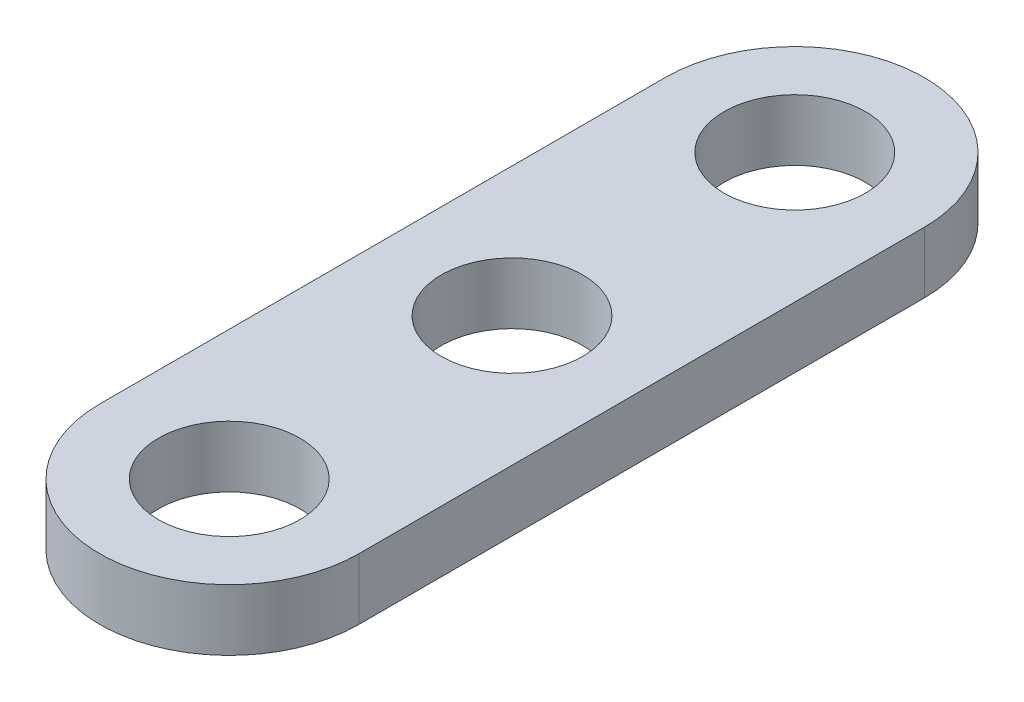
ISO-10303-21;
HEADER;
FILE_DESCRIPTION(('STEP AP214'),'2;1');
FILE_NAME('part.step','',(''),(''),'','','');
FILE_SCHEMA(('AUTOMOTIVE_DESIGN { 1 0 10303 214 1 1 1 1 }'));
ENDSEC;
DATA;
#1=APPLICATION_CONTEXT('core data for automotive mechanical design processes');
#2=APPLICATION_PROTOCOL_DEFINITION('international standard','automotive_design',2000,#1);
#3=PRODUCT_CONTEXT('',#1,'mechanical');
#4=PRODUCT('Part','Part','',(#3));
#5=PRODUCT_RELATED_PRODUCT_CATEGORY('part','',(#4));
#6=PRODUCT_DEFINITION_FORMATION('','',#4);
#7=PRODUCT_DEFINITION_CONTEXT('part definition',#1,'design');
#8=PRODUCT_DEFINITION('design','',#6,#7);
#9=PRODUCT_DEFINITION_SHAPE('','',#8);
#10=(LENGTH_UNIT() NAMED_UNIT(*) SI_UNIT(.MILLI.,.METRE.));
#11=(NAMED_UNIT(*) PLANE_ANGLE_UNIT() SI_UNIT($,.RADIAN.));
#12=(NAMED_UNIT(*) SI_UNIT($,.STERADIAN.) SOLID_ANGLE_UNIT());
#13=UNCERTAINTY_MEASURE_WITH_UNIT(LENGTH_MEASURE(1.E-05),#10,'distance_accuracy_value','');
#14=(GEOMETRIC_REPRESENTATION_CONTEXT(3) GLOBAL_UNCERTAINTY_ASSIGNED_CONTEXT((#13)) GLOBAL_UNIT_ASSIGNED_CONTEXT((#10,
#11,#12)) REPRESENTATION_CONTEXT('',''));
#15=CARTESIAN_POINT('',(0.,0.,0.));
#16=DIRECTION('',(0.,0.,1.));
#17=DIRECTION('',(1.,0.,0.));
#18=AXIS2_PLACEMENT_3D('',#15,#16,#17);
#19=CARTESIAN_POINT('',(0.,2.6,-12.));
#20=DIRECTION('',(0.,-1.,0.));
#21=DIRECTION('',(0.,0.,-1.));
#22=AXIS2_PLACEMENT_3D('',#19,#20,#21);
#23=PLANE('',#22);
#24=CARTESIAN_POINT('',(0.,2.6,-12.));
#25=DIRECTION('',(0.,1.,0.));
#26=DIRECTION('',(0.,0.,-1.));
#27=AXIS2_PLACEMENT_3D('',#24,#25,#26);
#28=CIRCLE('',#27,5.5);
#29=CARTESIAN_POINT('',(5.50000000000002,2.6,-12.));
#30=VERTEX_POINT('',#29);
#31=CARTESIAN_POINT('',(-5.49999999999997,2.6,-12.));
#32=VERTEX_POINT('',#31);
#33=EDGE_CURVE('E98',#30,#32,#28,.T.);
#34=ORIENTED_EDGE('',*,*,#33,.T.);
#35=DIRECTION('',(0.,0.,1.));
#36=VECTOR('',#35,1.);
#37=CARTESIAN_POINT('',(-5.49999999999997,2.6,12.));
#38=LINE('',#37,#36);
#39=CARTESIAN_POINT('',(-5.49999999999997,2.6,12.));
#40=VERTEX_POINT('',#39);
#41=EDGE_CURVE('E91',#32,#40,#38,.T.);
#42=ORIENTED_EDGE('',*,*,#41,.T.);
#43=CARTESIAN_POINT('',(0.,2.6,12.));
#44=DIRECTION('',(0.,1.,0.));
#45=DIRECTION('',(0.,0.,1.));
#46=AXIS2_PLACEMENT_3D('',#43,#44,#45);
#47=CIRCLE('',#46,5.5);
#48=CARTESIAN_POINT('',(5.50000000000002,2.6,12.));
#49=VERTEX_POINT('',#48);
#50=EDGE_CURVE('E96',#40,#49,#47,.T.);
#51=ORIENTED_EDGE('',*,*,#50,.T.);
#52=DIRECTION('',(0.,0.,-1.));
#53=VECTOR('',#52,1.);
#54=CARTESIAN_POINT('',(5.50000000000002,2.6,12.));
#55=LINE('',#54,#53);
#56=EDGE_CURVE('E62',#49,#30,#55,.T.);
#57=ORIENTED_EDGE('',*,*,#56,.T.);
#58=EDGE_LOOP('',(#34,#42,#51,#57));
#59=FACE_BOUND('',#58,.T.);
#60=CARTESIAN_POINT('',(0.,2.6,-12.));
#61=DIRECTION('',(0.,1.,0.));
#62=DIRECTION('',(0.,0.,1.));
#63=AXIS2_PLACEMENT_3D('',#60,#61,#62);
#64=CIRCLE('',#63,3.);
#65=CARTESIAN_POINT('',(0.,2.6,-9.));
#66=VERTEX_POINT('',#65);
#67=EDGE_CURVE('E117',#66,#66,#64,.T.);
#68=ORIENTED_EDGE('',*,*,#67,.F.);
#69=EDGE_LOOP('',(#68));
#70=FACE_BOUND('',#69,.T.);
#71=CARTESIAN_POINT('',(0.,2.6,0.));
#72=DIRECTION('',(0.,1.,0.));
#73=DIRECTION('',(0.,0.,1.));
#74=AXIS2_PLACEMENT_3D('',#71,#72,#73);
#75=CIRCLE('',#74,3.);
#76=CARTESIAN_POINT('',(0.,2.6,3.));
#77=VERTEX_POINT('',#76);
#78=EDGE_CURVE('E139',#77,#77,#75,.T.);
#79=ORIENTED_EDGE('',*,*,#78,.F.);
#80=EDGE_LOOP('',(#79));
#81=FACE_BOUND('',#80,.T.);
#82=CARTESIAN_POINT('',(0.,2.6,12.));
#83=DIRECTION('',(0.,1.,0.));
#84=DIRECTION('',(0.,0.,1.));
#85=AXIS2_PLACEMENT_3D('',#82,#83,#84);
#86=CIRCLE('',#85,3.);
#87=CARTESIAN_POINT('',(0.,2.6,15.));
#88=VERTEX_POINT('',#87);
#89=EDGE_CURVE('E146',#88,#88,#86,.T.);
#90=ORIENTED_EDGE('',*,*,#89,.F.);
#91=EDGE_LOOP('',(#90));
#92=FACE_BOUND('',#91,.T.);
#93=ADVANCED_FACE('F44',(#59,#70,#81,#92),#23,.F.);
#94=CARTESIAN_POINT('',(0.,0.,-12.));
#95=DIRECTION('',(0.,-1.,0.));
#96=DIRECTION('',(0.,0.,-1.));
#97=AXIS2_PLACEMENT_3D('',#94,#95,#96);
#98=PLANE('',#97);
#99=CARTESIAN_POINT('',(0.,0.,0.));
#100=DIRECTION('',(0.,1.,0.));
#101=DIRECTION('',(0.,0.,1.));
#102=AXIS2_PLACEMENT_3D('',#99,#100,#101);
#103=CIRCLE('',#102,3.);
#104=CARTESIAN_POINT('',(0.,0.,3.));
#105=VERTEX_POINT('',#104);
#106=EDGE_CURVE('E145',#105,#105,#103,.T.);
#107=ORIENTED_EDGE('',*,*,#106,.T.);
#108=EDGE_LOOP('',(#107));
#109=FACE_BOUND('',#108,.T.);
#110=CARTESIAN_POINT('',(0.,0.,-12.));
#111=DIRECTION('',(0.,1.,0.));
#112=DIRECTION('',(0.,0.,-1.));
#113=AXIS2_PLACEMENT_3D('',#110,#111,#112);
#114=CIRCLE('',#113,5.5);
#115=CARTESIAN_POINT('',(5.50000000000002,0.,-12.));
#116=VERTEX_POINT('',#115);
#117=CARTESIAN_POINT('',(-5.49999999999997,0.,-12.));
#118=VERTEX_POINT('',#117);
#119=EDGE_CURVE('E111',#116,#118,#114,.T.);
#120=ORIENTED_EDGE('',*,*,#119,.F.);
#121=DIRECTION('',(0.,0.,-1.));
#122=VECTOR('',#121,1.);
#123=CARTESIAN_POINT('',(5.50000000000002,0.,12.));
#124=LINE('',#123,#122);
#125=CARTESIAN_POINT('',(5.50000000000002,0.,12.));
#126=VERTEX_POINT('',#125);
#127=EDGE_CURVE('E88',#126,#116,#124,.T.);
#128=ORIENTED_EDGE('',*,*,#127,.F.);
#129=CARTESIAN_POINT('',(0.,0.,12.));
#130=DIRECTION('',(0.,1.,0.));
#131=DIRECTION('',(0.,0.,1.));
#132=AXIS2_PLACEMENT_3D('',#129,#130,#131);
#133=CIRCLE('',#132,5.5);
#134=CARTESIAN_POINT('',(-5.49999999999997,0.,12.));
#135=VERTEX_POINT('',#134);
#136=EDGE_CURVE('E79',#135,#126,#133,.T.);
#137=ORIENTED_EDGE('',*,*,#136,.F.);
#138=DIRECTION('',(0.,0.,1.));
#139=VECTOR('',#138,1.);
#140=CARTESIAN_POINT('',(-5.49999999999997,0.,12.));
#141=LINE('',#140,#139);
#142=EDGE_CURVE('E103',#118,#135,#141,.T.);
#143=ORIENTED_EDGE('',*,*,#142,.F.);
#144=EDGE_LOOP('',(#120,#128,#137,#143));
#145=FACE_BOUND('',#144,.T.);
#146=CARTESIAN_POINT('',(0.,0.,-12.));
#147=DIRECTION('',(0.,1.,0.));
#148=DIRECTION('',(0.,0.,1.));
#149=AXIS2_PLACEMENT_3D('',#146,#147,#148);
#150=CIRCLE('',#149,3.);
#151=CARTESIAN_POINT('',(0.,0.,-9.));
#152=VERTEX_POINT('',#151);
#153=EDGE_CURVE('E138',#152,#152,#150,.T.);
#154=ORIENTED_EDGE('',*,*,#153,.T.);
#155=EDGE_LOOP('',(#154));
#156=FACE_BOUND('',#155,.T.);
#157=CARTESIAN_POINT('',(0.,0.,12.));
#158=DIRECTION('',(0.,1.,0.));
#159=DIRECTION('',(0.,0.,1.));
#160=AXIS2_PLACEMENT_3D('',#157,#158,#159);
#161=CIRCLE('',#160,3.);
#162=CARTESIAN_POINT('',(0.,0.,15.));
#163=VERTEX_POINT('',#162);
#164=EDGE_CURVE('E155',#163,#163,#161,.T.);
#165=ORIENTED_EDGE('',*,*,#164,.T.);
#166=EDGE_LOOP('',(#165));
#167=FACE_BOUND('',#166,.T.);
#168=ADVANCED_FACE('F131',(#109,#145,#156,#167),#98,.T.);
#169=CARTESIAN_POINT('',(0.,2.6,-12.));
#170=DIRECTION('',(0.,-1.,0.));
#171=DIRECTION('',(0.,0.,-1.));
#172=AXIS2_PLACEMENT_3D('',#169,#170,#171);
#173=CYLINDRICAL_SURFACE('',#172,5.5);
#174=ORIENTED_EDGE('',*,*,#119,.T.);
#175=DIRECTION('',(0.,-1.,0.));
#176=VECTOR('',#175,1.);
#177=CARTESIAN_POINT('',(-5.49999999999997,2.6,-12.));
#178=LINE('',#177,#176);
#179=EDGE_CURVE('E11',#32,#118,#178,.T.);
#180=ORIENTED_EDGE('',*,*,#179,.F.);
#181=ORIENTED_EDGE('',*,*,#33,.F.);
#182=DIRECTION('',(0.,-1.,0.));
#183=VECTOR('',#182,1.);
#184=CARTESIAN_POINT('',(5.50000000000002,2.6,-12.));
#185=LINE('',#184,#183);
#186=EDGE_CURVE('E109',#30,#116,#185,.T.);
#187=ORIENTED_EDGE('',*,*,#186,.T.);
#188=EDGE_LOOP('',(#174,#180,#181,#187));
#189=FACE_BOUND('',#188,.T.);
#190=ADVANCED_FACE('F50',(#189),#173,.T.);
#191=CARTESIAN_POINT('',(-5.49999999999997,2.6,12.));
#192=DIRECTION('',(1.,0.,0.));
#193=DIRECTION('',(0.,0.,-1.));
#194=AXIS2_PLACEMENT_3D('',#191,#192,#193);
#195=PLANE('',#194);
#196=ORIENTED_EDGE('',*,*,#142,.T.);
#197=DIRECTION('',(0.,-1.,0.));
#198=VECTOR('',#197,1.);
#199=CARTESIAN_POINT('',(-5.49999999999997,2.6,12.));
#200=LINE('',#199,#198);
#201=EDGE_CURVE('E54',#40,#135,#200,.T.);
#202=ORIENTED_EDGE('',*,*,#201,.F.);
#203=ORIENTED_EDGE('',*,*,#41,.F.);
#204=ORIENTED_EDGE('',*,*,#179,.T.);
#205=EDGE_LOOP('',(#196,#202,#203,#204));
#206=FACE_BOUND('',#205,.T.);
#207=ADVANCED_FACE('F105',(#206),#195,.F.);
#208=CARTESIAN_POINT('',(0.,2.6,12.));
#209=DIRECTION('',(0.,-1.,0.));
#210=DIRECTION('',(0.,0.,-1.));
#211=AXIS2_PLACEMENT_3D('',#208,#209,#210);
#212=CYLINDRICAL_SURFACE('',#211,5.5);
#213=ORIENTED_EDGE('',*,*,#136,.T.);
#214=DIRECTION('',(0.,-1.,0.));
#215=VECTOR('',#214,1.);
#216=CARTESIAN_POINT('',(5.50000000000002,2.6,12.));
#217=LINE('',#216,#215);
#218=EDGE_CURVE('E104',#49,#126,#217,.T.);
#219=ORIENTED_EDGE('',*,*,#218,.F.);
#220=ORIENTED_EDGE('',*,*,#50,.F.);
#221=ORIENTED_EDGE('',*,*,#201,.T.);
#222=EDGE_LOOP('',(#213,#219,#220,#221));
#223=FACE_BOUND('',#222,.T.);
#224=ADVANCED_FACE('F106',(#223),#212,.T.);
#225=CARTESIAN_POINT('',(5.50000000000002,2.6,12.));
#226=DIRECTION('',(-1.,0.,0.));
#227=DIRECTION('',(0.,0.,1.));
#228=AXIS2_PLACEMENT_3D('',#225,#226,#227);
#229=PLANE('',#228);
#230=ORIENTED_EDGE('',*,*,#127,.T.);
#231=ORIENTED_EDGE('',*,*,#186,.F.);
#232=ORIENTED_EDGE('',*,*,#56,.F.);
#233=ORIENTED_EDGE('',*,*,#218,.T.);
#234=EDGE_LOOP('',(#230,#231,#232,#233));
#235=FACE_BOUND('',#234,.T.);
#236=ADVANCED_FACE('F126',(#235),#229,.F.);
#237=CARTESIAN_POINT('',(0.,2.6,-12.));
#238=DIRECTION('',(0.,-1.,0.));
#239=DIRECTION('',(0.,0.,-1.));
#240=AXIS2_PLACEMENT_3D('',#237,#238,#239);
#241=CYLINDRICAL_SURFACE('',#240,3.);
#242=ORIENTED_EDGE('',*,*,#67,.T.);
#243=EDGE_LOOP('',(#242));
#244=FACE_BOUND('',#243,.T.);
#245=ORIENTED_EDGE('',*,*,#153,.F.);
#246=EDGE_LOOP('',(#245));
#247=FACE_BOUND('',#246,.T.);
#248=ADVANCED_FACE('F171',(#244,#247),#241,.F.);
#249=CARTESIAN_POINT('',(0.,2.6,0.));
#250=DIRECTION('',(0.,-1.,0.));
#251=DIRECTION('',(0.,0.,-1.));
#252=AXIS2_PLACEMENT_3D('',#249,#250,#251);
#253=CYLINDRICAL_SURFACE('',#252,3.);
#254=ORIENTED_EDGE('',*,*,#78,.T.);
#255=EDGE_LOOP('',(#254));
#256=FACE_BOUND('',#255,.T.);
#257=ORIENTED_EDGE('',*,*,#106,.F.);
#258=EDGE_LOOP('',(#257));
#259=FACE_BOUND('',#258,.T.);
#260=ADVANCED_FACE('F216',(#256,#259),#253,.F.);
#261=CARTESIAN_POINT('',(0.,2.6,12.));
#262=DIRECTION('',(0.,-1.,0.));
#263=DIRECTION('',(0.,0.,-1.));
#264=AXIS2_PLACEMENT_3D('',#261,#262,#263);
#265=CYLINDRICAL_SURFACE('',#264,3.);
#266=ORIENTED_EDGE('',*,*,#89,.T.);
#267=EDGE_LOOP('',(#266));
#268=FACE_BOUND('',#267,.T.);
#269=ORIENTED_EDGE('',*,*,#164,.F.);
#270=EDGE_LOOP('',(#269));
#271=FACE_BOUND('',#270,.T.);
#272=ADVANCED_FACE('F159',(#268,#271),#265,.F.);
#273=CLOSED_SHELL('',(#93,#168,#190,#207,#224,#236,#248,#260,#272));
#274=MANIFOLD_SOLID_BREP('B2',#273);
#275=ADVANCED_BREP_SHAPE_REPRESENTATION('',(#18,#274),#14);
#276=SHAPE_DEFINITION_REPRESENTATION(#9,#275);
ENDSEC;
END-ISO-10303-21;
